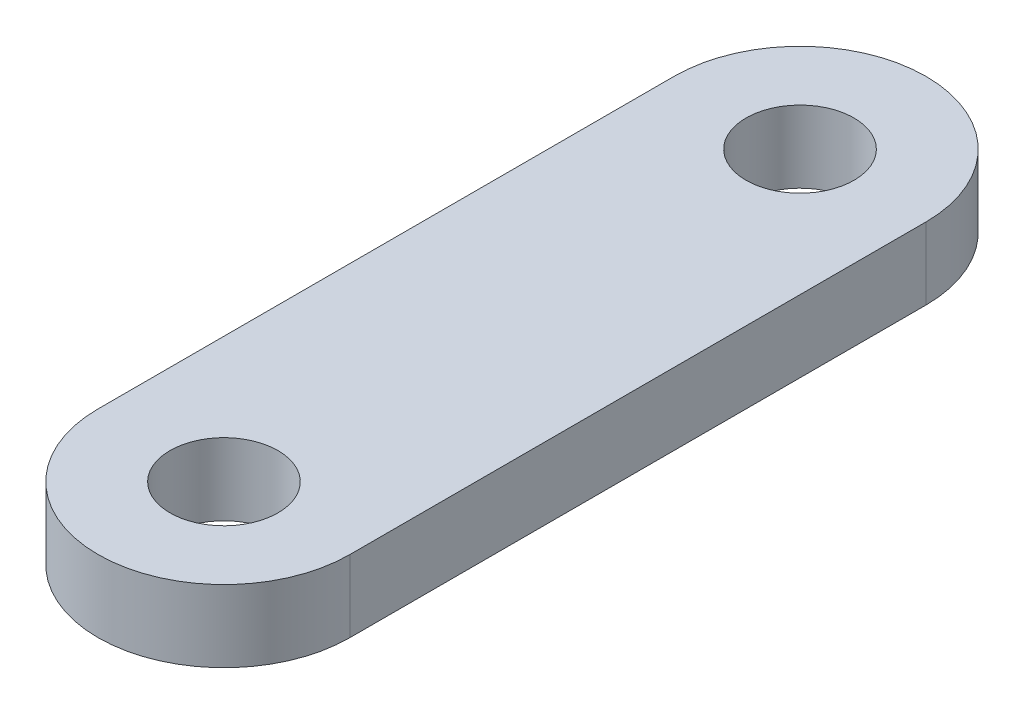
ISO-10303-21;
HEADER;
FILE_DESCRIPTION(('STEP AP214'),'2;1');
FILE_NAME('part.step','',(''),(''),'','','');
FILE_SCHEMA(('AUTOMOTIVE_DESIGN { 1 0 10303 214 1 1 1 1 }'));
ENDSEC;
DATA;
#1=APPLICATION_CONTEXT('core data for automotive mechanical design processes');
#2=APPLICATION_PROTOCOL_DEFINITION('international standard','automotive_design',2000,#1);
#3=PRODUCT_CONTEXT('',#1,'mechanical');
#4=PRODUCT('Part','Part','',(#3));
#5=PRODUCT_RELATED_PRODUCT_CATEGORY('part','',(#4));
#6=PRODUCT_DEFINITION_FORMATION('','',#4);
#7=PRODUCT_DEFINITION_CONTEXT('part definition',#1,'design');
#8=PRODUCT_DEFINITION('design','',#6,#7);
#9=PRODUCT_DEFINITION_SHAPE('','',#8);
#10=(LENGTH_UNIT() NAMED_UNIT(*) SI_UNIT(.MILLI.,.METRE.));
#11=(NAMED_UNIT(*) PLANE_ANGLE_UNIT() SI_UNIT($,.RADIAN.));
#12=(NAMED_UNIT(*) SI_UNIT($,.STERADIAN.) SOLID_ANGLE_UNIT());
#13=UNCERTAINTY_MEASURE_WITH_UNIT(LENGTH_MEASURE(1.E-05),#10,'distance_accuracy_value','');
#14=(GEOMETRIC_REPRESENTATION_CONTEXT(3) GLOBAL_UNCERTAINTY_ASSIGNED_CONTEXT((#13)) GLOBAL_UNIT_ASSIGNED_CONTEXT((#10,
#11,#12)) REPRESENTATION_CONTEXT('',''));
#15=CARTESIAN_POINT('',(0.,0.,0.));
#16=DIRECTION('',(0.,0.,1.));
#17=DIRECTION('',(1.,0.,0.));
#18=AXIS2_PLACEMENT_3D('',#15,#16,#17);
#19=CARTESIAN_POINT('',(0.,2.,-8.));
#20=DIRECTION('',(0.,-1.,0.));
#21=DIRECTION('',(0.,0.,-1.));
#22=AXIS2_PLACEMENT_3D('',#19,#20,#21);
#23=PLANE('',#22);
#24=CARTESIAN_POINT('',(0.,2.,-8.));
#25=DIRECTION('',(0.,1.,0.));
#26=DIRECTION('',(0.,0.,-1.));
#27=AXIS2_PLACEMENT_3D('',#24,#25,#26);
#28=CIRCLE('',#27,3.5);
#29=CARTESIAN_POINT('',(3.5,2.,-8.));
#30=VERTEX_POINT('',#29);
#31=CARTESIAN_POINT('',(-3.5,2.,-8.));
#32=VERTEX_POINT('',#31);
#33=EDGE_CURVE('E87',#30,#32,#28,.T.);
#34=ORIENTED_EDGE('',*,*,#33,.T.);
#35=DIRECTION('',(0.,0.,1.));
#36=VECTOR('',#35,1.);
#37=CARTESIAN_POINT('',(-3.5,2.,-8.));
#38=LINE('',#37,#36);
#39=CARTESIAN_POINT('',(-3.5,2.,8.));
#40=VERTEX_POINT('',#39);
#41=EDGE_CURVE('E115',#32,#40,#38,.T.);
#42=ORIENTED_EDGE('',*,*,#41,.T.);
#43=CARTESIAN_POINT('',(0.,2.,8.));
#44=DIRECTION('',(0.,-1.,0.));
#45=DIRECTION('',(0.,0.,1.));
#46=AXIS2_PLACEMENT_3D('',#43,#44,#45);
#47=CIRCLE('',#46,3.5);
#48=CARTESIAN_POINT('',(3.5,2.,8.));
#49=VERTEX_POINT('',#48);
#50=EDGE_CURVE('E94',#49,#40,#47,.T.);
#51=ORIENTED_EDGE('',*,*,#50,.F.);
#52=DIRECTION('',(0.,0.,-1.));
#53=VECTOR('',#52,1.);
#54=CARTESIAN_POINT('',(3.5,2.,-8.));
#55=LINE('',#54,#53);
#56=EDGE_CURVE('E54',#49,#30,#55,.T.);
#57=ORIENTED_EDGE('',*,*,#56,.T.);
#58=EDGE_LOOP('',(#34,#42,#51,#57));
#59=FACE_BOUND('',#58,.T.);
#60=CARTESIAN_POINT('',(0.,2.,-8.));
#61=DIRECTION('',(0.,1.,0.));
#62=DIRECTION('',(0.,0.,1.));
#63=AXIS2_PLACEMENT_3D('',#60,#61,#62);
#64=CIRCLE('',#63,1.5);
#65=CARTESIAN_POINT('',(0.,2.,-6.5));
#66=VERTEX_POINT('',#65);
#67=EDGE_CURVE('E109',#66,#66,#64,.T.);
#68=ORIENTED_EDGE('',*,*,#67,.F.);
#69=EDGE_LOOP('',(#68));
#70=FACE_BOUND('',#69,.T.);
#71=CARTESIAN_POINT('',(0.,2.,8.));
#72=DIRECTION('',(0.,-1.,0.));
#73=DIRECTION('',(0.,0.,-1.));
#74=AXIS2_PLACEMENT_3D('',#71,#72,#73);
#75=CIRCLE('',#74,1.5);
#76=CARTESIAN_POINT('',(0.,2.,6.5));
#77=VERTEX_POINT('',#76);
#78=EDGE_CURVE('E99',#77,#77,#75,.T.);
#79=ORIENTED_EDGE('',*,*,#78,.T.);
#80=EDGE_LOOP('',(#79));
#81=FACE_BOUND('',#80,.T.);
#82=ADVANCED_FACE('F37',(#59,#70,#81),#23,.F.);
#83=CARTESIAN_POINT('',(0.,0.,-8.));
#84=DIRECTION('',(0.,-1.,0.));
#85=DIRECTION('',(0.,0.,-1.));
#86=AXIS2_PLACEMENT_3D('',#83,#84,#85);
#87=PLANE('',#86);
#88=CARTESIAN_POINT('',(0.,0.,-8.));
#89=DIRECTION('',(0.,1.,0.));
#90=DIRECTION('',(0.,0.,-1.));
#91=AXIS2_PLACEMENT_3D('',#88,#89,#90);
#92=CIRCLE('',#91,3.5);
#93=CARTESIAN_POINT('',(3.5,0.,-8.));
#94=VERTEX_POINT('',#93);
#95=CARTESIAN_POINT('',(-3.5,0.,-8.));
#96=VERTEX_POINT('',#95);
#97=EDGE_CURVE('E85',#94,#96,#92,.T.);
#98=ORIENTED_EDGE('',*,*,#97,.F.);
#99=DIRECTION('',(0.,0.,-1.));
#100=VECTOR('',#99,1.);
#101=CARTESIAN_POINT('',(3.5,0.,-8.));
#102=LINE('',#101,#100);
#103=CARTESIAN_POINT('',(3.5,0.,8.));
#104=VERTEX_POINT('',#103);
#105=EDGE_CURVE('E79',#104,#94,#102,.T.);
#106=ORIENTED_EDGE('',*,*,#105,.F.);
#107=CARTESIAN_POINT('',(0.,0.,8.));
#108=DIRECTION('',(0.,-1.,0.));
#109=DIRECTION('',(0.,0.,1.));
#110=AXIS2_PLACEMENT_3D('',#107,#108,#109);
#111=CIRCLE('',#110,3.5);
#112=CARTESIAN_POINT('',(-3.5,0.,8.));
#113=VERTEX_POINT('',#112);
#114=EDGE_CURVE('E83',#104,#113,#111,.T.);
#115=ORIENTED_EDGE('',*,*,#114,.T.);
#116=DIRECTION('',(0.,0.,1.));
#117=VECTOR('',#116,1.);
#118=CARTESIAN_POINT('',(-3.5,0.,-8.));
#119=LINE('',#118,#117);
#120=EDGE_CURVE('E66',#96,#113,#119,.T.);
#121=ORIENTED_EDGE('',*,*,#120,.F.);
#122=EDGE_LOOP('',(#98,#106,#115,#121));
#123=FACE_BOUND('',#122,.T.);
#124=CARTESIAN_POINT('',(0.,0.,-8.));
#125=DIRECTION('',(0.,1.,0.));
#126=DIRECTION('',(0.,0.,1.));
#127=AXIS2_PLACEMENT_3D('',#124,#125,#126);
#128=CIRCLE('',#127,1.5);
#129=CARTESIAN_POINT('',(0.,0.,-6.5));
#130=VERTEX_POINT('',#129);
#131=EDGE_CURVE('E108',#130,#130,#128,.T.);
#132=ORIENTED_EDGE('',*,*,#131,.T.);
#133=EDGE_LOOP('',(#132));
#134=FACE_BOUND('',#133,.T.);
#135=CARTESIAN_POINT('',(0.,0.,8.));
#136=DIRECTION('',(0.,-1.,0.));
#137=DIRECTION('',(0.,0.,-1.));
#138=AXIS2_PLACEMENT_3D('',#135,#136,#137);
#139=CIRCLE('',#138,1.5);
#140=CARTESIAN_POINT('',(0.,0.,6.5));
#141=VERTEX_POINT('',#140);
#142=EDGE_CURVE('E103',#141,#141,#139,.T.);
#143=ORIENTED_EDGE('',*,*,#142,.F.);
#144=EDGE_LOOP('',(#143));
#145=FACE_BOUND('',#144,.T.);
#146=ADVANCED_FACE('F80',(#123,#134,#145),#87,.T.);
#147=CARTESIAN_POINT('',(0.,2.,-8.));
#148=DIRECTION('',(0.,-1.,0.));
#149=DIRECTION('',(0.,0.,-1.));
#150=AXIS2_PLACEMENT_3D('',#147,#148,#149);
#151=CYLINDRICAL_SURFACE('',#150,3.5);
#152=ORIENTED_EDGE('',*,*,#97,.T.);
#153=DIRECTION('',(0.,-1.,0.));
#154=VECTOR('',#153,1.);
#155=CARTESIAN_POINT('',(-3.5,2.,-8.));
#156=LINE('',#155,#154);
#157=EDGE_CURVE('E11',#32,#96,#156,.T.);
#158=ORIENTED_EDGE('',*,*,#157,.F.);
#159=ORIENTED_EDGE('',*,*,#33,.F.);
#160=DIRECTION('',(0.,-1.,0.));
#161=VECTOR('',#160,1.);
#162=CARTESIAN_POINT('',(3.5,2.,-8.));
#163=LINE('',#162,#161);
#164=EDGE_CURVE('E46',#30,#94,#163,.T.);
#165=ORIENTED_EDGE('',*,*,#164,.T.);
#166=EDGE_LOOP('',(#152,#158,#159,#165));
#167=FACE_BOUND('',#166,.T.);
#168=ADVANCED_FACE('F39',(#167),#151,.T.);
#169=CARTESIAN_POINT('',(-3.5,2.,-8.));
#170=DIRECTION('',(1.,0.,0.));
#171=DIRECTION('',(0.,0.,-1.));
#172=AXIS2_PLACEMENT_3D('',#169,#170,#171);
#173=PLANE('',#172);
#174=ORIENTED_EDGE('',*,*,#120,.T.);
#175=DIRECTION('',(0.,-1.,0.));
#176=VECTOR('',#175,1.);
#177=CARTESIAN_POINT('',(-3.5,2.,8.));
#178=LINE('',#177,#176);
#179=EDGE_CURVE('E93',#40,#113,#178,.T.);
#180=ORIENTED_EDGE('',*,*,#179,.F.);
#181=ORIENTED_EDGE('',*,*,#41,.F.);
#182=ORIENTED_EDGE('',*,*,#157,.T.);
#183=EDGE_LOOP('',(#174,#180,#181,#182));
#184=FACE_BOUND('',#183,.T.);
#185=ADVANCED_FACE('F124',(#184),#173,.F.);
#186=CARTESIAN_POINT('',(3.5,2.,-8.));
#187=DIRECTION('',(-1.,0.,0.));
#188=DIRECTION('',(0.,0.,1.));
#189=AXIS2_PLACEMENT_3D('',#186,#187,#188);
#190=PLANE('',#189);
#191=ORIENTED_EDGE('',*,*,#105,.T.);
#192=ORIENTED_EDGE('',*,*,#164,.F.);
#193=ORIENTED_EDGE('',*,*,#56,.F.);
#194=DIRECTION('',(0.,-1.,0.));
#195=VECTOR('',#194,1.);
#196=CARTESIAN_POINT('',(3.5,2.,8.));
#197=LINE('',#196,#195);
#198=EDGE_CURVE('E89',#49,#104,#197,.T.);
#199=ORIENTED_EDGE('',*,*,#198,.T.);
#200=EDGE_LOOP('',(#191,#192,#193,#199));
#201=FACE_BOUND('',#200,.T.);
#202=ADVANCED_FACE('F90',(#201),#190,.F.);
#203=CARTESIAN_POINT('',(0.,2.,-8.));
#204=DIRECTION('',(0.,-1.,0.));
#205=DIRECTION('',(0.,0.,-1.));
#206=AXIS2_PLACEMENT_3D('',#203,#204,#205);
#207=CYLINDRICAL_SURFACE('',#206,1.5);
#208=ORIENTED_EDGE('',*,*,#67,.T.);
#209=EDGE_LOOP('',(#208));
#210=FACE_BOUND('',#209,.T.);
#211=ORIENTED_EDGE('',*,*,#131,.F.);
#212=EDGE_LOOP('',(#211));
#213=FACE_BOUND('',#212,.T.);
#214=ADVANCED_FACE('F130',(#210,#213),#207,.F.);
#215=CARTESIAN_POINT('',(0.,2.,8.));
#216=DIRECTION('',(0.,-1.,0.));
#217=DIRECTION('',(0.,0.,1.));
#218=AXIS2_PLACEMENT_3D('',#215,#216,#217);
#219=CYLINDRICAL_SURFACE('',#218,3.5);
#220=ORIENTED_EDGE('',*,*,#114,.F.);
#221=ORIENTED_EDGE('',*,*,#198,.F.);
#222=ORIENTED_EDGE('',*,*,#50,.T.);
#223=ORIENTED_EDGE('',*,*,#179,.T.);
#224=EDGE_LOOP('',(#220,#221,#222,#223));
#225=FACE_BOUND('',#224,.T.);
#226=ADVANCED_FACE('F97',(#225),#219,.T.);
#227=CARTESIAN_POINT('',(0.,2.,8.));
#228=DIRECTION('',(0.,-1.,0.));
#229=DIRECTION('',(0.,0.,1.));
#230=AXIS2_PLACEMENT_3D('',#227,#228,#229);
#231=CYLINDRICAL_SURFACE('',#230,1.5);
#232=ORIENTED_EDGE('',*,*,#78,.F.);
#233=EDGE_LOOP('',(#232));
#234=FACE_BOUND('',#233,.T.);
#235=ORIENTED_EDGE('',*,*,#142,.T.);
#236=EDGE_LOOP('',(#235));
#237=FACE_BOUND('',#236,.T.);
#238=ADVANCED_FACE('F144',(#234,#237),#231,.F.);
#239=CLOSED_SHELL('',(#82,#146,#168,#185,#202,#214,#226,#238));
#240=MANIFOLD_SOLID_BREP('B2',#239);
#241=ADVANCED_BREP_SHAPE_REPRESENTATION('',(#18,#240),#14);
#242=SHAPE_DEFINITION_REPRESENTATION(#9,#241);
ENDSEC;
END-ISO-10303-21;
